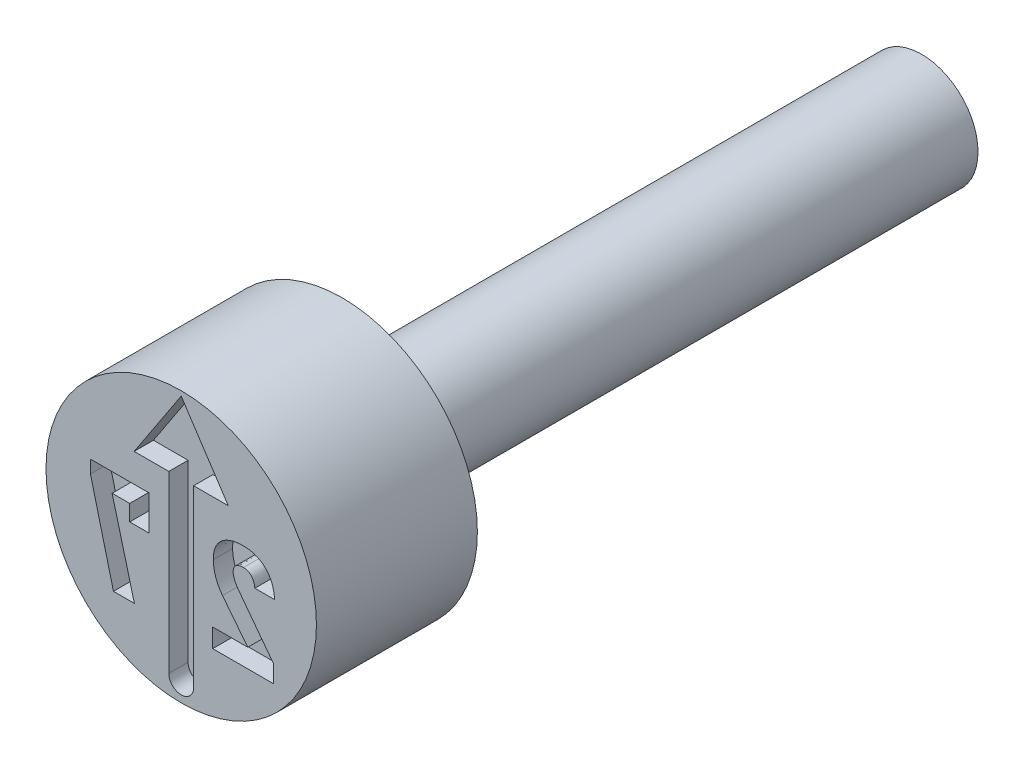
from build123d import *

# Parameters (mm, degrees)
CUT_EXTRUDE4_DEPTH = 0.6
CUT_EXTRUDE5_DEPTH = 0.6


with BuildPart() as part:
    # Sketch2 → Revolve1 (revolve)
    with BuildSketch(Plane(origin=(0, 0, 0), x_dir=(0, 0, -1), z_dir=(1, 0, 0)), mode=Mode.PRIVATE) as revolve1_sk:
        Polygon((0, 4.2), (0, 0), (23, 0), (23, 1.75), (5, 1.75), (5, 4.2), align=None)
    revolve(revolve1_sk.sketch.rotate(Axis((0, 0, -0.403888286), (0, 0, -1)), 90), axis=Axis((0, 0, -0.403888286), (0, 0, -1)))

    # Sketch3 → Cut-Extrude4 (cut)
    with BuildSketch(Plane.XY):
        with BuildLine():
            Line((0.385708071, 1.835361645), (0.385708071, -3.596727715))
            ThreePointArc((0.385708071, -3.596727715), (0, -3.982435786), (-0.385708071, -3.596727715))
            Line((-0.385708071, -3.596727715), (-0.385708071, 1.835361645))
            Line((-0.385708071, 1.835361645), (-1.461883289, 1.835361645))
            Line((-1.461883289, 1.835361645), (0, 4.054283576))
            Line((0, 4.054283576), (1.461883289, 1.835361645))
            Line((1.461883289, 1.835361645), (0.385708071, 1.835361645))
        make_face()
    extrude(amount=-CUT_EXTRUDE4_DEPTH, mode=Mode.SUBTRACT)

    # Sketch4 → Cut-Extrude5 (cut)
    with BuildSketch(Plane.XY):
        with BuildLine():
            Line((2.862987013, -2.25), (2.862987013, -1.705844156))
            Line((2.862987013, -1.705844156), (1.769480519, -0.257142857))
            add(Edge.make_bspline(
                [(1.769480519, -0.257142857), (1.746576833, -0.224870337), (1.701949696, -0.16198831), (1.661558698, -0.075632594), (1.636396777, -0.007928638), (1.624405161, 0.041170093), (1.615850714, 0.088014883), (1.614797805, 0.118795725), (1.614285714, 0.133766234)],
                knots=[0, 0, 0, 0, 1.664252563, 3.24274559, 3.998498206, 4.704056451, 5.369707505, 6, 6, 6, 6], degree=3))
            Line((1.614285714, 0.133766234), (1.614285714, 0.138311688))
            add(Edge.make_bspline(
                [(1.614285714, 0.138311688), (1.615172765, 0.158772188), (1.616872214, 0.197971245), (1.632883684, 0.253203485), (1.659125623, 0.301302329), (1.696710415, 0.341031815), (1.743500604, 0.372455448), (1.799486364, 0.394600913), (1.863935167, 0.407299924), (1.909680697, 0.40889856), (1.933766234, 0.40974026)],
                knots=[0, 0, 0, 0, 1.029992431, 1.973301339, 2.872554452, 3.768620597, 4.704316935, 5.693697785, 6.785705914, 8, 8, 8, 8], degree=3))
            add(Edge.make_bspline(
                [(1.933766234, 0.40974026), (1.957290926, 0.408822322), (2.003000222, 0.407038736), (2.067709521, 0.387271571), (2.126018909, 0.356265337), (2.176286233, 0.312023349), (2.217911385, 0.25647586), (2.251694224, 0.191064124), (2.274639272, 0.114607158), (2.282755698, 0.059876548), (2.287012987, 0.031168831)],
                knots=[0, 0, 0, 0, 0.980828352, 1.905783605, 2.800718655, 3.724477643, 4.680224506, 5.688112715, 6.78735127, 8, 8, 8, 8], degree=3))
            Line((2.287012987, 0.031168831), (2.287012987, 0.029220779))
            Line((2.287012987, 0.029220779), (2.902597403, 0.029220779))
            Line((2.902597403, 0.029220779), (2.902597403, 0.031168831))
            add(Edge.make_bspline(
                [(2.902597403, 0.031168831), (2.899559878, 0.068261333), (2.893630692, 0.140665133), (2.874192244, 0.245400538), (2.849068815, 0.344054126), (2.817108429, 0.43660631), (2.776039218, 0.52198544), (2.729896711, 0.601976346), (2.674398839, 0.674104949), (2.613648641, 0.740784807), (2.545983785, 0.79951546), (2.473834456, 0.851323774), (2.396109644, 0.894436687), (2.313990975, 0.930201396), (2.226567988, 0.957345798), (2.134982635, 0.977679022), (2.038183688, 0.989405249), (1.972109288, 0.990829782), (1.938311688, 0.991558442)],
                knots=[0, 0, 0, 0, 1.173229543, 2.290119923, 3.354877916, 4.382703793, 5.372196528, 6.339367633, 7.289741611, 8.236749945, 9.180232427, 10.11040526, 11.033485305, 11.978374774, 12.930610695, 13.916256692, 14.93414813, 16, 16, 16, 16], degree=3))
            add(Edge.make_bspline(
                [(1.938311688, 0.991558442), (1.901918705, 0.991041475), (1.831139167, 0.990036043), (1.728096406, 0.979182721), (1.631144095, 0.962801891), (1.540438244, 0.938837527), (1.456343, 0.907578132), (1.378606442, 0.869886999), (1.30706607, 0.82544294), (1.242269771, 0.774150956), (1.183969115, 0.716942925), (1.133787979, 0.653238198), (1.090347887, 0.584324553), (1.056391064, 0.50886535), (1.028435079, 0.428635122), (1.010334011, 0.342195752), (0.998136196, 0.250564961), (0.996792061, 0.187488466), (0.996103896, 0.155194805)],
                knots=[0, 0, 0, 0, 1.219700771, 2.37215663, 3.469774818, 4.513610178, 5.512457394, 6.473141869, 7.405450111, 8.330272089, 9.238546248, 10.1372905, 11.043445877, 11.962355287, 12.905558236, 13.886315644, 14.917844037, 16, 16, 16, 16], degree=3))
            Line((0.996103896, 0.155194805), (0.996103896, 0.152597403))
            add(Edge.make_bspline(
                [(0.996103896, 0.152597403), (0.996931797, 0.116187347), (0.998589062, 0.043302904), (1.013548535, -0.065778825), (1.037655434, -0.174303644), (1.070762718, -0.281747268), (1.111890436, -0.38624861), (1.161251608, -0.48637652), (1.216962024, -0.582175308), (1.26110749, -0.641301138), (1.283116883, -0.670779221)],
                knots=[0, 0, 0, 0, 0.984368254, 1.970475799, 2.971844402, 3.988480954, 5.008197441, 6.005725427, 7.005724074, 8, 8, 8, 8], degree=3))
            Line((1.283116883, -0.670779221), (2.067532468, -1.668181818))
            Line((2.067532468, -1.668181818), (0.978571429, -1.668181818))
            Line((0.978571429, -1.668181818), (0.978571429, -2.25))
            Line((0.978571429, -2.25), (2.862987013, -2.25))
        make_face()
        Polygon((-2.819272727, 0.95), (-2.819272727, 0.548701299), (-2.104987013, -2.25), (-1.454337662, -2.25), (-2.146545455, 0.368181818), (-1.599142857, 0.368181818), (-1.599142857, -0.130519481), (-0.998493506, -0.130519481), (-0.998493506, 0.95), align=None)
    extrude(amount=-CUT_EXTRUDE5_DEPTH, mode=Mode.SUBTRACT)


solid = part.part
